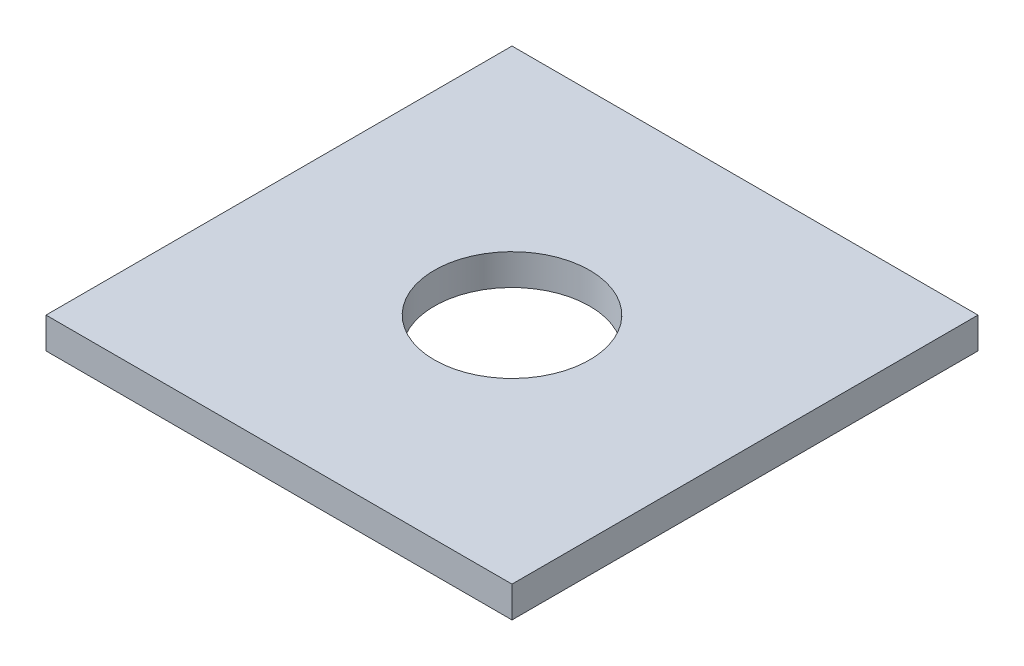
from build123d import *

# Parameters (mm, degrees)
SKETCH1_W          = 90
SKETCH1_H          = 6
BASE_EXTRUDE_DEPTH = 45
SKETCH2_R          = 15
CUT_EXTRUDE1_DEPTH = 64.921827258


with BuildPart() as part:
    # Sketch1 → Base-Extrude (new, symmetric)
    with BuildSketch(Plane.XY):
        with Locations((0, 3)):
            Rectangle(SKETCH1_W, SKETCH1_H)
    extrude(amount=BASE_EXTRUDE_DEPTH, both=True)

    # Sketch2 → Cut-Extrude1 (cut, through all)
    with BuildSketch(Plane(origin=(0, 6, 0), x_dir=(-1, 0, 0), z_dir=(0, 1, 0))):
        with Locations(Location((0, 0, 0), (0, 0, 90))):
            Circle(SKETCH2_R)
    extrude(amount=-CUT_EXTRUDE1_DEPTH, mode=Mode.SUBTRACT)


solid = part.part
